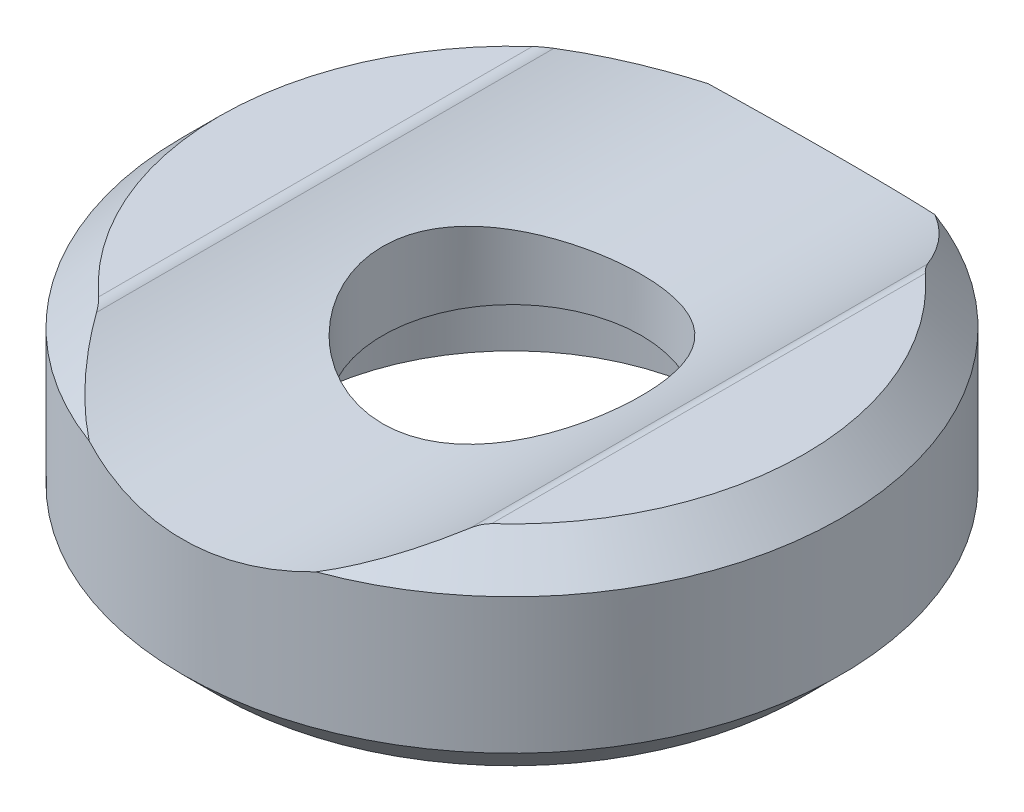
ISO-10303-21;
HEADER;
FILE_DESCRIPTION(('STEP AP214'),'2;1');
FILE_NAME('part.step','',(''),(''),'','','');
FILE_SCHEMA(('AUTOMOTIVE_DESIGN { 1 0 10303 214 1 1 1 1 }'));
ENDSEC;
DATA;
#1=APPLICATION_CONTEXT('core data for automotive mechanical design processes');
#2=APPLICATION_PROTOCOL_DEFINITION('international standard','automotive_design',2000,#1);
#3=PRODUCT_CONTEXT('',#1,'mechanical');
#4=PRODUCT('Part','Part','',(#3));
#5=PRODUCT_RELATED_PRODUCT_CATEGORY('part','',(#4));
#6=PRODUCT_DEFINITION_FORMATION('','',#4);
#7=PRODUCT_DEFINITION_CONTEXT('part definition',#1,'design');
#8=PRODUCT_DEFINITION('design','',#6,#7);
#9=PRODUCT_DEFINITION_SHAPE('','',#8);
#10=(LENGTH_UNIT() NAMED_UNIT(*) SI_UNIT(.MILLI.,.METRE.));
#11=(NAMED_UNIT(*) PLANE_ANGLE_UNIT() SI_UNIT($,.RADIAN.));
#12=(NAMED_UNIT(*) SI_UNIT($,.STERADIAN.) SOLID_ANGLE_UNIT());
#13=UNCERTAINTY_MEASURE_WITH_UNIT(LENGTH_MEASURE(1.E-05),#10,'distance_accuracy_value','');
#14=(GEOMETRIC_REPRESENTATION_CONTEXT(3) GLOBAL_UNCERTAINTY_ASSIGNED_CONTEXT((#13)) GLOBAL_UNIT_ASSIGNED_CONTEXT((#10,
#11,#12)) REPRESENTATION_CONTEXT('',''));
#15=CARTESIAN_POINT('',(0.,0.,0.));
#16=DIRECTION('',(0.,0.,1.));
#17=DIRECTION('',(1.,0.,0.));
#18=AXIS2_PLACEMENT_3D('',#15,#16,#17);
#19=CARTESIAN_POINT('',(0.,0.,0.));
#20=DIRECTION('',(0.,-1.,0.));
#21=DIRECTION('',(0.,0.,-1.));
#22=AXIS2_PLACEMENT_3D('',#19,#20,#21);
#23=CYLINDRICAL_SURFACE('',#22,2.1);
#24=CARTESIAN_POINT('',(-1.4860910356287,2.69361672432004,1.48375652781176));
#25=CARTESIAN_POINT('',(-1.56880387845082,2.7155404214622,1.40091427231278));
#26=CARTESIAN_POINT('',(-1.64455914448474,2.73758521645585,1.3111728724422));
#27=CARTESIAN_POINT('',(-1.78026026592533,2.77951750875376,1.12000215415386));
#28=CARTESIAN_POINT('',(-1.84021054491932,2.79940560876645,1.01857611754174));
#29=CARTESIAN_POINT('',(-1.94267466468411,2.83474834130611,0.806192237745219));
#30=CARTESIAN_POINT('',(-1.98514420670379,2.85019168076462,0.695211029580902));
#31=CARTESIAN_POINT('',(-2.05084769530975,2.87457179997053,0.467015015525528));
#32=CARTESIAN_POINT('',(-2.07408983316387,2.88351135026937,0.349802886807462));
#33=CARTESIAN_POINT('',(-2.09976776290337,2.89341546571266,0.118108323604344));
#34=CARTESIAN_POINT('',(-2.10308730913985,2.89471870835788,0.00373813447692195));
#35=CARTESIAN_POINT('',(-2.09114003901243,2.89008564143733,-0.223867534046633));
#36=CARTESIAN_POINT('',(-2.07587502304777,2.88415003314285,-0.337103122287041));
#37=CARTESIAN_POINT('',(-2.02814783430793,2.86610351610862,-0.555649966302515));
#38=CARTESIAN_POINT('',(-1.99623087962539,2.85418882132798,-0.661097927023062));
#39=CARTESIAN_POINT('',(-1.91662995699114,2.82566831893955,-0.865178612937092));
#40=CARTESIAN_POINT('',(-1.86894242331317,2.80906145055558,-0.963809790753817));
#41=CARTESIAN_POINT('',(-1.75659802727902,2.77207006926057,-1.15644538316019));
#42=CARTESIAN_POINT('',(-1.69125747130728,2.75154620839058,-1.25002387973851));
#43=CARTESIAN_POINT('',(-1.54644899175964,2.70945667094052,-1.42528112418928));
#44=CARTESIAN_POINT('',(-1.46697629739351,2.68789064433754,-1.50695583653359));
#45=CARTESIAN_POINT('',(-1.29121774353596,2.64479444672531,-1.66044059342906));
#46=CARTESIAN_POINT('',(-1.19427113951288,2.62332481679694,-1.73151391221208));
#47=CARTESIAN_POINT('',(-0.989129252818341,2.58401251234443,-1.85634934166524));
#48=CARTESIAN_POINT('',(-0.880935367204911,2.566169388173,-1.91011359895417));
#49=CARTESIAN_POINT('',(-0.65818342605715,2.53639099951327,-1.99771417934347));
#50=CARTESIAN_POINT('',(-0.54376922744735,2.52435815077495,-2.03188161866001));
#51=CARTESIAN_POINT('',(-0.310323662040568,2.50712745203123,-2.08035929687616));
#52=CARTESIAN_POINT('',(-0.191294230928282,2.50192676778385,-2.09467777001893));
#53=CARTESIAN_POINT('',(0.0409855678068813,2.49904531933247,-2.1026367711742));
#54=CARTESIAN_POINT('',(0.154195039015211,2.50096794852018,-2.09736781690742));
#55=CARTESIAN_POINT('',(0.377999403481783,2.51124671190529,-2.06877777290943));
#56=CARTESIAN_POINT('',(0.488594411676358,2.51960256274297,-2.04545747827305));
#57=CARTESIAN_POINT('',(0.702964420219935,2.54175849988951,-1.98197207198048));
#58=CARTESIAN_POINT('',(0.806798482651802,2.55550094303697,-1.94198503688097));
#59=CARTESIAN_POINT('',(1.00637369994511,2.58708195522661,-1.84647198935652));
#60=CARTESIAN_POINT('',(1.10211301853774,2.60492145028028,-1.79094246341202));
#61=CARTESIAN_POINT('',(1.28768413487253,2.64391608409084,-1.66288103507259));
#62=CARTESIAN_POINT('',(1.37702160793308,2.66518821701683,-1.58966860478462));
#63=CARTESIAN_POINT('',(1.54249017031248,2.70821608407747,-1.4296775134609));
#64=CARTESIAN_POINT('',(1.61861661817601,2.72997198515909,-1.34289410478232));
#65=CARTESIAN_POINT('',(1.7586757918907,2.77255507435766,-1.15388749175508));
#66=CARTESIAN_POINT('',(1.82197147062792,2.79330626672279,-1.05117304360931));
#67=CARTESIAN_POINT('',(1.93028609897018,2.83032989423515,-0.835772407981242));
#68=CARTESIAN_POINT('',(1.97531012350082,2.84660357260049,-0.72308899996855));
#69=CARTESIAN_POINT('',(2.04437135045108,2.87212070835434,-0.494356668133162));
#70=CARTESIAN_POINT('',(2.06898959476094,2.88155776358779,-0.378505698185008));
#71=CARTESIAN_POINT('',(2.09838595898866,2.89287153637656,-0.143970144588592));
#72=CARTESIAN_POINT('',(2.10317303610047,2.89475166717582,-0.0252868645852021));
#73=CARTESIAN_POINT('',(2.09302947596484,2.89081878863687,0.203984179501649));
#74=CARTESIAN_POINT('',(2.07925564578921,2.88545707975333,0.314633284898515));
#75=CARTESIAN_POINT('',(2.0345474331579,2.86850105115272,0.531903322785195));
#76=CARTESIAN_POINT('',(2.00361133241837,2.85690610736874,0.638523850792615));
#77=CARTESIAN_POINT('',(1.92538106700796,2.82874468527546,0.845733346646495));
#78=CARTESIAN_POINT('',(1.87797185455,2.81214335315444,0.946273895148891));
#79=CARTESIAN_POINT('',(1.76823487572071,2.77580976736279,1.13823479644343));
#80=CARTESIAN_POINT('',(1.70590248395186,2.75607654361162,1.22965230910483));
#81=CARTESIAN_POINT('',(1.56354398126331,2.71420026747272,1.40677825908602));
#82=CARTESIAN_POINT('',(1.48266050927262,2.69198366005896,1.49178139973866));
#83=CARTESIAN_POINT('',(1.30771206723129,2.64862821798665,1.64729822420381));
#84=CARTESIAN_POINT('',(1.21364442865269,2.62748960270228,1.71780896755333));
#85=CARTESIAN_POINT('',(1.01219419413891,2.58806278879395,1.8438830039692));
#86=CARTESIAN_POINT('',(0.904550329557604,2.56985338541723,1.89905544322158));
#87=CARTESIAN_POINT('',(0.680705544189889,2.53897766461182,1.99028432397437));
#88=CARTESIAN_POINT('',(0.564507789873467,2.52630930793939,2.02634779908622));
#89=CARTESIAN_POINT('',(0.332465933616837,2.50842082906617,2.07675690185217));
#90=CARTESIAN_POINT('',(0.216843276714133,2.5028899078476,2.09201055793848));
#91=CARTESIAN_POINT('',(-0.0154336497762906,2.49885875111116,2.10315739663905));
#92=CARTESIAN_POINT('',(-0.132087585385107,2.50035631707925,2.09905663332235));
#93=CARTESIAN_POINT('',(-0.357950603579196,2.50999810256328,2.07226039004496));
#94=CARTESIAN_POINT('',(-0.467266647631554,2.5178606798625,2.05035267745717));
#95=CARTESIAN_POINT('',(-0.68059181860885,2.53907122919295,1.98974892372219));
#96=CARTESIAN_POINT('',(-0.784599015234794,2.55242118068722,1.95104682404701));
#97=CARTESIAN_POINT('',(-0.996690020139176,2.58515523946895,1.85252806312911));
#98=CARTESIAN_POINT('',(-1.10377973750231,2.60506923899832,1.79074317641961));
#99=CARTESIAN_POINT('',(-1.30515882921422,2.64781592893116,1.6497531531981));
#100=CARTESIAN_POINT('',(-1.39944264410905,2.67064987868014,1.57054048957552));
#101=CARTESIAN_POINT('',(-1.4860910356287,2.69361672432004,1.48375652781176));
#102=B_SPLINE_CURVE_WITH_KNOTS('',3,(#24,#25,#26,#27,#28,#29,#30,#31,#32,#33,#34,#35,#36,#37,
#38,#39,#40,#41,#42,#43,#44,#45,#46,#47,#48,#49,#50,#51,#52,#53,#54,#55,#56,#57,#58,#59,#60,#61,
#62,#63,#64,#65,#66,#67,#68,#69,#70,#71,#72,#73,#74,#75,#76,#77,#78,#79,#80,#81,#82,#83,#84,#85,
#86,#87,#88,#89,#90,#91,#92,#93,#94,#95,#96,#97,#98,#99,#100,#101),.UNSPECIFIED.,.T.,.F.,(4,2,2,
2,2,2,2,2,2,2,2,2,2,2,2,2,2,2,2,2,2,2,2,2,2,2,2,2,2,2,2,2,2,2,2,2,2,2,4),(0.,0.356879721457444,
0.713659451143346,1.07133782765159,1.42886374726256,1.77040538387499,2.11191393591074,
2.44288397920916,2.77392890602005,3.12030756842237,3.46680338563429,3.83137195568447,
4.19589529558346,4.55406284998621,4.91208177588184,5.2504744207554,5.58885216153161,
5.92370358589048,6.25863076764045,6.60941571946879,6.96032366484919,7.3257923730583,
7.69115950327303,8.04572611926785,8.40013256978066,8.73344164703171,9.06678410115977,
9.40250302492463,9.73832613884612,10.0949688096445,10.4516837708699,10.8167942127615,
11.1817701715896,11.5302480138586,11.8786168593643,12.2123623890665,12.546228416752,
12.9199270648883,13.2937874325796),.UNSPECIFIED.);
#103=CARTESIAN_POINT('',(-1.4860910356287,2.69361672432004,1.48375652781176));
#104=VERTEX_POINT('',#103);
#105=EDGE_CURVE('E197',#104,#104,#102,.F.);
#106=ORIENTED_EDGE('',*,*,#105,.T.);
#107=EDGE_LOOP('',(#106));
#108=FACE_BOUND('',#107,.T.);
#109=CARTESIAN_POINT('',(0.,1.64120486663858,0.));
#110=DIRECTION('',(0.,-1.,0.));
#111=DIRECTION('',(0.,0.,-1.));
#112=AXIS2_PLACEMENT_3D('',#109,#110,#111);
#113=CIRCLE('',#112,2.1);
#114=CARTESIAN_POINT('',(0.,1.64120486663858,-2.1));
#115=VERTEX_POINT('',#114);
#116=EDGE_CURVE('E129',#115,#115,#113,.T.);
#117=ORIENTED_EDGE('',*,*,#116,.T.);
#118=EDGE_LOOP('',(#117));
#119=FACE_BOUND('',#118,.T.);
#120=ADVANCED_FACE('F14',(#108,#119),#23,.F.);
#121=CARTESIAN_POINT('',(0.,0.799999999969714,0.));
#122=DIRECTION('',(0.,-1.,0.));
#123=DIRECTION('',(1.,0.,0.));
#124=AXIS2_PLACEMENT_3D('',#121,#122,#123);
#125=CONICAL_SURFACE('',#124,3.49999999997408,1.02974425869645);
#126=ORIENTED_EDGE('',*,*,#116,.F.);
#127=EDGE_LOOP('',(#126));
#128=FACE_BOUND('',#127,.T.);
#129=CARTESIAN_POINT('',(0.,0.8,0.));
#130=DIRECTION('',(0.,-1.,0.));
#131=DIRECTION('',(0.,0.,-1.));
#132=AXIS2_PLACEMENT_3D('',#129,#130,#131);
#133=CIRCLE('',#132,3.5);
#134=CARTESIAN_POINT('',(0.,0.8,-3.5));
#135=VERTEX_POINT('',#134);
#136=EDGE_CURVE('E191',#135,#135,#133,.T.);
#137=ORIENTED_EDGE('',*,*,#136,.T.);
#138=EDGE_LOOP('',(#137));
#139=FACE_BOUND('',#138,.T.);
#140=ADVANCED_FACE('F248',(#128,#139),#125,.F.);
#141=CARTESIAN_POINT('',(0.,0.,0.));
#142=DIRECTION('',(0.,-1.,0.));
#143=DIRECTION('',(0.,0.,-1.));
#144=AXIS2_PLACEMENT_3D('',#141,#142,#143);
#145=CYLINDRICAL_SURFACE('',#144,3.5);
#146=ORIENTED_EDGE('',*,*,#136,.F.);
#147=EDGE_LOOP('',(#146));
#148=FACE_BOUND('',#147,.T.);
#149=CARTESIAN_POINT('',(0.,0.,0.));
#150=DIRECTION('',(0.,-1.,0.));
#151=DIRECTION('',(0.,0.,-1.));
#152=AXIS2_PLACEMENT_3D('',#149,#150,#151);
#153=CIRCLE('',#152,3.5);
#154=CARTESIAN_POINT('',(0.,0.,-3.5));
#155=VERTEX_POINT('',#154);
#156=EDGE_CURVE('E83',#155,#155,#153,.F.);
#157=ORIENTED_EDGE('',*,*,#156,.F.);
#158=EDGE_LOOP('',(#157));
#159=FACE_BOUND('',#158,.T.);
#160=ADVANCED_FACE('F246',(#148,#159),#145,.F.);
#161=CARTESIAN_POINT('',(4.75,3.4,0.));
#162=DIRECTION('',(0.,1.,0.));
#163=DIRECTION('',(0.,0.,1.));
#164=AXIS2_PLACEMENT_3D('',#161,#162,#163);
#165=PLANE('',#164);
#166=CARTESIAN_POINT('',(0.,3.39999999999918,0.));
#167=DIRECTION('',(0.,-1.,0.));
#168=DIRECTION('',(0.,0.,-1.));
#169=AXIS2_PLACEMENT_3D('',#166,#167,#168);
#170=CIRCLE('',#169,4.75000000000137);
#171=CARTESIAN_POINT('',(3.1890437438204,3.39999999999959,-3.52029828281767));
#172=VERTEX_POINT('',#171);
#173=CARTESIAN_POINT('',(3.18904374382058,3.39999999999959,3.5202982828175));
#174=VERTEX_POINT('',#173);
#175=EDGE_CURVE('E160',#172,#174,#170,.T.);
#176=ORIENTED_EDGE('',*,*,#175,.F.);
#177=DIRECTION('',(0.,0.,-1.));
#178=VECTOR('',#177,1.);
#179=CARTESIAN_POINT('',(3.1890437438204,3.4,6.35));
#180=LINE('',#179,#178);
#181=EDGE_CURVE('E78',#174,#172,#180,.T.);
#182=ORIENTED_EDGE('',*,*,#181,.F.);
#183=EDGE_LOOP('',(#176,#182));
#184=FACE_BOUND('',#183,.T.);
#185=ADVANCED_FACE('F140',(#184),#165,.T.);
#186=CARTESIAN_POINT('',(3.1890437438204,3.1,6.35));
#187=DIRECTION('',(0.,0.,-1.));
#188=DIRECTION('',(-1.,0.,0.));
#189=AXIS2_PLACEMENT_3D('',#186,#187,#188);
#190=CYLINDRICAL_SURFACE('',#189,0.300000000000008);
#191=CARTESIAN_POINT('',(3.03220552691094,3.35573770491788,-3.7135805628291));
#192=CARTESIAN_POINT('',(3.04091923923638,3.36107484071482,-3.69957571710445));
#193=CARTESIAN_POINT('',(3.0500043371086,3.36604022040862,-3.68564852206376));
#194=CARTESIAN_POINT('',(3.06898271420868,3.37513163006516,-3.65800132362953));
#195=CARTESIAN_POINT('',(3.07887860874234,3.37925478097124,-3.64428217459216));
#196=CARTESIAN_POINT('',(3.0992822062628,3.38645661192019,-3.61746611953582));
#197=CARTESIAN_POINT('',(3.1097739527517,3.38955432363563,-3.60436227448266));
#198=CARTESIAN_POINT('',(3.13157774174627,3.39465738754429,-3.5786562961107));
#199=CARTESIAN_POINT('',(3.14288843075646,3.39666449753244,-3.56605338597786));
#200=CARTESIAN_POINT('',(3.1601613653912,3.39865800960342,-3.54805497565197));
#201=CARTESIAN_POINT('',(3.16577854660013,3.39915154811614,-3.54238208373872));
#202=CARTESIAN_POINT('',(3.17724223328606,3.39982284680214,-3.53120080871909));
#203=CARTESIAN_POINT('',(3.1830896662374,3.3999991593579,-3.52569329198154));
#204=CARTESIAN_POINT('',(3.18904374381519,3.40000000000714,-3.52029828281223));
#205=B_SPLINE_CURVE_WITH_KNOTS('',3,(#191,#192,#193,#194,#195,#196,#197,#198,#199,#200,#201,
#202,#203,#204),.UNSPECIFIED.,.F.,.F.,(4,2,2,2,2,2,4),(0.,0.0520154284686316,0.1042057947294,
0.155364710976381,0.206440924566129,0.230427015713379,0.254522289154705),.UNSPECIFIED.);
#206=CARTESIAN_POINT('',(3.03220552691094,3.35573770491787,-3.7135805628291));
#207=VERTEX_POINT('',#206);
#208=EDGE_CURVE('E153',#207,#172,#205,.T.);
#209=ORIENTED_EDGE('',*,*,#208,.F.);
#210=DIRECTION('',(0.,0.,-1.));
#211=VECTOR('',#210,1.);
#212=CARTESIAN_POINT('',(3.03220552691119,3.35573770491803,6.35));
#213=LINE('',#212,#211);
#214=CARTESIAN_POINT('',(3.03220552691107,3.35573770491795,3.71358056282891));
#215=VERTEX_POINT('',#214);
#216=EDGE_CURVE('E182',#207,#215,#213,.F.);
#217=ORIENTED_EDGE('',*,*,#216,.T.);
#218=CARTESIAN_POINT('',(3.18904374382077,3.4,3.52029828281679));
#219=CARTESIAN_POINT('',(3.17957230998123,3.39999465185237,3.52888607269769));
#220=CARTESIAN_POINT('',(3.17037189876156,3.3995519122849,3.53774807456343));
#221=CARTESIAN_POINT('',(3.15249357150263,3.39790145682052,3.55589448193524));
#222=CARTESIAN_POINT('',(3.14381493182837,3.3966948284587,3.56517826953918));
#223=CARTESIAN_POINT('',(3.11869143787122,3.39212725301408,3.59329011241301));
#224=CARTESIAN_POINT('',(3.1029386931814,3.38781320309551,3.61258530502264));
#225=CARTESIAN_POINT('',(3.07801784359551,3.37890217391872,3.64546903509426));
#226=CARTESIAN_POINT('',(3.06837865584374,3.37485705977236,3.65886477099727));
#227=CARTESIAN_POINT('',(3.04977146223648,3.36591327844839,3.68600492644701));
#228=CARTESIAN_POINT('',(3.04080934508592,3.36100813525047,3.69975126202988));
#229=CARTESIAN_POINT('',(3.03220552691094,3.35573770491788,3.71358056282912));
#230=B_SPLINE_CURVE_WITH_KNOTS('',3,(#218,#219,#220,#221,#222,#223,#224,#225,#226,#227,#228,
#229),.UNSPECIFIED.,.F.,.F.,(4,2,2,2,2,4),(0.,0.0383164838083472,0.0765785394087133,
0.152204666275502,0.203148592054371,0.254494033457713),.UNSPECIFIED.);
#231=EDGE_CURVE('E145',#174,#215,#230,.T.);
#232=ORIENTED_EDGE('',*,*,#231,.F.);
#233=ORIENTED_EDGE('',*,*,#181,.T.);
#234=EDGE_LOOP('',(#209,#217,#232,#233));
#235=FACE_BOUND('',#234,.T.);
#236=ADVANCED_FACE('F134',(#235),#190,.T.);
#237=CARTESIAN_POINT('',(-3.18904374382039,3.1,6.35));
#238=DIRECTION('',(0.,0.,-1.));
#239=DIRECTION('',(-1.,0.,0.));
#240=AXIS2_PLACEMENT_3D('',#237,#238,#239);
#241=CYLINDRICAL_SURFACE('',#240,0.299999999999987);
#242=CARTESIAN_POINT('',(-3.18904374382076,3.4,3.5202982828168));
#243=CARTESIAN_POINT('',(-3.17957230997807,3.39999465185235,3.5288860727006));
#244=CARTESIAN_POINT('',(-3.17037189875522,3.39955191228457,3.53774807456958));
#245=CARTESIAN_POINT('',(-3.15249357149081,3.39790145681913,3.55589448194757));
#246=CARTESIAN_POINT('',(-3.14381493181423,3.3966948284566,3.56517826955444));
#247=CARTESIAN_POINT('',(-3.11869143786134,3.39212725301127,3.59329011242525));
#248=CARTESIAN_POINT('',(-3.10293869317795,3.38781320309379,3.61258530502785));
#249=CARTESIAN_POINT('',(-3.07801784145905,3.37890217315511,3.64546903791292));
#250=CARTESIAN_POINT('',(-3.06837865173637,3.37485705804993,3.65886477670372));
#251=CARTESIAN_POINT('',(-3.04977145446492,3.36591327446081,3.68600493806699));
#252=CARTESIAN_POINT('',(-3.04080933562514,3.36100812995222,3.69975127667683));
#253=CARTESIAN_POINT('',(-3.0322055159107,3.35573769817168,3.71358058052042));
#254=B_SPLINE_CURVE_WITH_KNOTS('',3,(#242,#243,#244,#245,#246,#247,#248,#249,#250,#251,#252,
#253),.UNSPECIFIED.,.F.,.F.,(4,2,2,2,2,4),(0.,0.0383164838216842,0.0765785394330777,
0.152204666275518,0.203148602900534,0.25449405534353),.UNSPECIFIED.);
#255=CARTESIAN_POINT('',(-3.18904374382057,3.39999999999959,3.52029828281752));
#256=VERTEX_POINT('',#255);
#257=CARTESIAN_POINT('',(-3.03220551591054,3.35573769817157,3.71358058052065));
#258=VERTEX_POINT('',#257);
#259=EDGE_CURVE('E77',#256,#258,#254,.T.);
#260=ORIENTED_EDGE('',*,*,#259,.T.);
#261=DIRECTION('',(0.,0.,-1.));
#262=VECTOR('',#261,1.);
#263=CARTESIAN_POINT('',(-3.0322055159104,3.35573769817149,6.35));
#264=LINE('',#263,#262);
#265=CARTESIAN_POINT('',(-3.03220551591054,3.35573769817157,-3.71358058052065));
#266=VERTEX_POINT('',#265);
#267=EDGE_CURVE('E75',#258,#266,#264,.T.);
#268=ORIENTED_EDGE('',*,*,#267,.T.);
#269=CARTESIAN_POINT('',(-3.03220551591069,3.35573769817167,-3.71358058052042));
#270=CARTESIAN_POINT('',(-3.04091922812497,3.36107483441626,-3.6995757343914));
#271=CARTESIAN_POINT('',(-3.05000432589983,3.36604021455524,-3.68564853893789));
#272=CARTESIAN_POINT('',(-3.06898270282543,3.37513162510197,-3.6580013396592));
#273=CARTESIAN_POINT('',(-3.07887859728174,3.37925477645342,-3.64428219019));
#274=CARTESIAN_POINT('',(-3.09928219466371,3.38645660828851,-3.61746613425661));
#275=CARTESIAN_POINT('',(-3.10977394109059,3.38955432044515,-3.6043622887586));
#276=CARTESIAN_POINT('',(-3.13157772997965,3.39465738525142,-3.57865630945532));
#277=CARTESIAN_POINT('',(-3.14288841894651,3.39666449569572,-3.56605339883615));
#278=CARTESIAN_POINT('',(-3.16016135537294,3.39865800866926,-3.5480549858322));
#279=CARTESIAN_POINT('',(-3.16577853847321,3.3991515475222,-3.54238209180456));
#280=CARTESIAN_POINT('',(-3.17724222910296,3.39982284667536,-3.53120081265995));
#281=CARTESIAN_POINT('',(-3.18308966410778,3.39999915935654,-3.52569329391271));
#282=CARTESIAN_POINT('',(-3.18904374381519,3.40000000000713,-3.52029828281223));
#283=B_SPLINE_CURVE_WITH_KNOTS('',3,(#269,#270,#271,#272,#273,#274,#275,#276,#277,#278,#279,
#280,#281,#282),.UNSPECIFIED.,.F.,.F.,(4,2,2,2,2,2,4),(0.,0.0520154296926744,0.104205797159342,
0.155364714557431,0.206440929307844,0.230427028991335,0.254522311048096),.UNSPECIFIED.);
#284=CARTESIAN_POINT('',(-3.18904374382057,3.39999999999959,-3.52029828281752));
#285=VERTEX_POINT('',#284);
#286=EDGE_CURVE('E67',#266,#285,#283,.T.);
#287=ORIENTED_EDGE('',*,*,#286,.T.);
#288=DIRECTION('',(0.,0.,1.));
#289=VECTOR('',#288,1.);
#290=CARTESIAN_POINT('',(-3.18904374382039,3.4,0.));
#291=LINE('',#290,#289);
#292=EDGE_CURVE('E73',#256,#285,#291,.F.);
#293=ORIENTED_EDGE('',*,*,#292,.F.);
#294=EDGE_LOOP('',(#260,#268,#287,#293));
#295=FACE_BOUND('',#294,.T.);
#296=ADVANCED_FACE('F72',(#295),#241,.T.);
#297=CARTESIAN_POINT('',(4.75,3.4,0.));
#298=DIRECTION('',(0.,1.,0.));
#299=DIRECTION('',(0.,0.,1.));
#300=AXIS2_PLACEMENT_3D('',#297,#298,#299);
#301=PLANE('',#300);
#302=ORIENTED_EDGE('',*,*,#292,.T.);
#303=CARTESIAN_POINT('',(0.,3.39999999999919,0.));
#304=DIRECTION('',(0.,-1.,0.));
#305=DIRECTION('',(0.,0.,-1.));
#306=AXIS2_PLACEMENT_3D('',#303,#304,#305);
#307=CIRCLE('',#306,4.75000000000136);
#308=EDGE_CURVE('E82',#256,#285,#307,.T.);
#309=ORIENTED_EDGE('',*,*,#308,.F.);
#310=EDGE_LOOP('',(#302,#309));
#311=FACE_BOUND('',#310,.T.);
#312=ADVANCED_FACE('F81',(#311),#301,.T.);
#313=CARTESIAN_POINT('',(3.5,0.,0.));
#314=DIRECTION('',(0.,-1.,0.));
#315=DIRECTION('',(0.,0.,-1.));
#316=AXIS2_PLACEMENT_3D('',#313,#314,#315);
#317=PLANE('',#316);
#318=ORIENTED_EDGE('',*,*,#156,.T.);
#319=EDGE_LOOP('',(#318));
#320=FACE_BOUND('',#319,.T.);
#321=CARTESIAN_POINT('',(0.,0.,0.));
#322=DIRECTION('',(0.,1.,0.));
#323=DIRECTION('',(0.,0.,1.));
#324=AXIS2_PLACEMENT_3D('',#321,#322,#323);
#325=CIRCLE('',#324,4.75000000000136);
#326=CARTESIAN_POINT('',(0.,0.,4.75000000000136));
#327=VERTEX_POINT('',#326);
#328=EDGE_CURVE('E86',#327,#327,#325,.T.);
#329=ORIENTED_EDGE('',*,*,#328,.F.);
#330=EDGE_LOOP('',(#329));
#331=FACE_BOUND('',#330,.T.);
#332=ADVANCED_FACE('F164',(#320,#331),#317,.T.);
#333=CARTESIAN_POINT('',(0.,2.79999999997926,0.));
#334=DIRECTION('',(0.,-1.,0.));
#335=DIRECTION('',(0.,0.,-1.));
#336=AXIS2_PLACEMENT_3D('',#333,#334,#335);
#337=CONICAL_SURFACE('',#336,5.35000000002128,0.785398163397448);
#338=ORIENTED_EDGE('',*,*,#231,.T.);
#339=CARTESIAN_POINT('',(3.03220552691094,3.35573770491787,3.7135805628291));
#340=CARTESIAN_POINT('',(2.95373914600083,3.30764336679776,3.83969593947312));
#341=CARTESIAN_POINT('',(2.87031289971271,3.25902339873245,3.96264552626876));
#342=CARTESIAN_POINT('',(2.69373311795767,3.16249972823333,4.1998110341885));
#343=CARTESIAN_POINT('',(2.60066920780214,3.11459345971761,4.31409285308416));
#344=CARTESIAN_POINT('',(2.40368575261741,3.02039667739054,4.53372365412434));
#345=CARTESIAN_POINT('',(2.29976702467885,2.97410604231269,4.63907330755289));
#346=CARTESIAN_POINT('',(2.07968558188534,2.88436731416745,4.83963302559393));
#347=CARTESIAN_POINT('',(1.9634246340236,2.84094730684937,4.93474738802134));
#348=CARTESIAN_POINT('',(1.84119526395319,2.80000000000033,5.02319619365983));
#349=B_SPLINE_CURVE_WITH_KNOTS('',3,(#339,#340,#341,#342,#343,#344,#345,#346,#347,#348),
.UNSPECIFIED.,.F.,.F.,(4,2,2,2,4),(0.,0.468402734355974,0.932785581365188,1.39713349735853,
1.86550237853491),.UNSPECIFIED.);
#350=CARTESIAN_POINT('',(1.84119526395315,2.80000000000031,5.02319619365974));
#351=VERTEX_POINT('',#350);
#352=EDGE_CURVE('E177',#215,#351,#349,.T.);
#353=ORIENTED_EDGE('',*,*,#352,.T.);
#354=CARTESIAN_POINT('',(0.,2.80000000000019,0.));
#355=DIRECTION('',(0.,-1.,0.));
#356=DIRECTION('',(0.,0.,-1.));
#357=AXIS2_PLACEMENT_3D('',#354,#355,#356);
#358=CIRCLE('',#357,5.35);
#359=CARTESIAN_POINT('',(1.84119526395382,2.80000000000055,-5.02319619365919));
#360=VERTEX_POINT('',#359);
#361=EDGE_CURVE('E195',#360,#351,#358,.T.);
#362=ORIENTED_EDGE('',*,*,#361,.F.);
#363=CARTESIAN_POINT('',(1.84119526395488,2.8000000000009,-5.02319619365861));
#364=CARTESIAN_POINT('',(1.946242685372,2.83518227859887,-4.94720104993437));
#365=CARTESIAN_POINT('',(2.04690015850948,2.87220892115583,-4.86624249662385));
#366=CARTESIAN_POINT('',(2.23956598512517,2.94882044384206,-4.69592428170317));
#367=CARTESIAN_POINT('',(2.33158503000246,2.98840205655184,-4.60657528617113));
#368=CARTESIAN_POINT('',(2.50622847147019,3.068564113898,-4.42200739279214));
#369=CARTESIAN_POINT('',(2.58895912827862,3.10912497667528,-4.32687953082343));
#370=CARTESIAN_POINT('',(2.74673075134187,3.19085494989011,-4.13070966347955));
#371=CARTESIAN_POINT('',(2.82177237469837,3.23202400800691,-4.02966816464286));
#372=CARTESIAN_POINT('',(2.91710023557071,3.28688813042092,-3.89126957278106));
#373=CARTESIAN_POINT('',(2.94066331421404,3.30067757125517,-3.85616726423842));
#374=CARTESIAN_POINT('',(2.98702192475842,3.32823684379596,-3.78532762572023));
#375=CARTESIAN_POINT('',(3.00981562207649,3.34200656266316,-3.74958905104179));
#376=CARTESIAN_POINT('',(3.032205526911,3.35573770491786,-3.71358056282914));
#377=B_SPLINE_CURVE_WITH_KNOTS('',3,(#363,#364,#365,#366,#367,#368,#369,#370,#371,#372,#373,
#374,#375,#376),.UNSPECIFIED.,.F.,.F.,(4,2,2,2,2,2,4),(0.,0.402649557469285,0.80479401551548,
1.20172890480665,1.59862984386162,1.73203114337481,1.86573081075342),.UNSPECIFIED.);
#378=EDGE_CURVE('E170',#360,#207,#377,.T.);
#379=ORIENTED_EDGE('',*,*,#378,.T.);
#380=ORIENTED_EDGE('',*,*,#208,.T.);
#381=ORIENTED_EDGE('',*,*,#175,.T.);
#382=EDGE_LOOP('',(#338,#353,#362,#379,#380,#381));
#383=FACE_BOUND('',#382,.T.);
#384=ADVANCED_FACE('F161',(#383),#337,.T.);
#385=CARTESIAN_POINT('',(0.,8.3,6.35));
#386=DIRECTION('',(0.,0.,-1.));
#387=DIRECTION('',(-1.,0.,0.));
#388=AXIS2_PLACEMENT_3D('',#385,#386,#387);
#389=CYLINDRICAL_SURFACE('',#388,5.8);
#390=ORIENTED_EDGE('',*,*,#105,.F.);
#391=EDGE_LOOP('',(#390));
#392=FACE_BOUND('',#391,.T.);
#393=CARTESIAN_POINT('',(-1.84119526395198,2.79999999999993,-5.02319619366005));
#394=CARTESIAN_POINT('',(-1.73808655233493,2.76546798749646,-5.06100395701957));
#395=CARTESIAN_POINT('',(-1.63300722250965,2.73353080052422,-5.09590380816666));
#396=CARTESIAN_POINT('',(-1.41939518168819,2.6752744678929,-5.15947719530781));
#397=CARTESIAN_POINT('',(-1.31086046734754,2.64895865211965,-5.18814704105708));
#398=CARTESIAN_POINT('',(-1.09112006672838,2.60245158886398,-5.23876475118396));
#399=CARTESIAN_POINT('',(-0.979918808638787,2.5822508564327,-5.26072302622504));
#400=CARTESIAN_POINT('',(-0.755409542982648,2.54828378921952,-5.29762132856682));
#401=CARTESIAN_POINT('',(-0.642102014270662,2.53451601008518,-5.3125629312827));
#402=CARTESIAN_POINT('',(-0.413658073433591,2.51362825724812,-5.33522420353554));
#403=CARTESIAN_POINT('',(-0.298515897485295,2.50653708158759,-5.34291258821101));
#404=CARTESIAN_POINT('',(-0.0677584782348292,2.49924698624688,-5.35081655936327));
#405=CARTESIAN_POINT('',(0.0478567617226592,2.49904801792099,-5.35103219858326));
#406=CARTESIAN_POINT('',(0.278634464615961,2.50554756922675,-5.34398549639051));
#407=CARTESIAN_POINT('',(0.393797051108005,2.5122440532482,-5.33672536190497));
#408=CARTESIAN_POINT('',(0.622780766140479,2.53238621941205,-5.31487402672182));
#409=CARTESIAN_POINT('',(0.736602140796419,2.54583064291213,-5.30028419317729));
#410=CARTESIAN_POINT('',(1.02119085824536,2.58797239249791,-5.25451041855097));
#411=CARTESIAN_POINT('',(1.19061726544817,2.62096935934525,-5.21863871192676));
#412=CARTESIAN_POINT('',(1.43909202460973,2.68072025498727,-5.15353056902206));
#413=CARTESIAN_POINT('',(1.52096673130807,2.7023444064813,-5.12994666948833));
#414=CARTESIAN_POINT('',(1.68266044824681,2.74880933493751,-5.07920475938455));
#415=CARTESIAN_POINT('',(1.7624797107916,2.77364971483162,-5.0520471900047));
#416=CARTESIAN_POINT('',(1.8411952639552,2.80000000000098,-5.02319619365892));
#417=B_SPLINE_CURVE_WITH_KNOTS('',3,(#393,#394,#395,#396,#397,#398,#399,#400,#401,#402,#403,
#404,#405,#406,#407,#408,#409,#410,#411,#412,#413,#414,#415,#416),.UNSPECIFIED.,.F.,.F.,(4,2,2,
2,2,2,2,2,2,2,2,4),(0.,0.345334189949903,0.690872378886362,1.03587183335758,1.38079378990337,
1.7271967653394,2.07359729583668,2.41989559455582,2.76612932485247,3.29338881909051,
3.55697807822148,3.82053482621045),.UNSPECIFIED.);
#418=CARTESIAN_POINT('',(-1.84119526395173,2.79999999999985,-5.02319619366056));
#419=VERTEX_POINT('',#418);
#420=EDGE_CURVE('E89',#419,#360,#417,.T.);
#421=ORIENTED_EDGE('',*,*,#420,.F.);
#422=CARTESIAN_POINT('',(-3.03220551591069,3.35573769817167,-3.71358058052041));
#423=CARTESIAN_POINT('',(-2.95373913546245,3.3076433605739,-3.83969595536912));
#424=CARTESIAN_POINT('',(-2.87031288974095,3.25902339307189,-3.96264554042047));
#425=CARTESIAN_POINT('',(-2.6937331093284,3.16249972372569,-4.19981104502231));
#426=CARTESIAN_POINT('',(-2.60066919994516,3.11459345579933,-4.31409286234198));
#427=CARTESIAN_POINT('',(-2.40368574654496,3.0203966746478,-4.53372366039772));
#428=CARTESIAN_POINT('',(-2.29976701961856,2.97410604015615,-4.63907331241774));
#429=CARTESIAN_POINT('',(-2.07968557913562,2.88436731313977,-4.83963302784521));
#430=CARTESIAN_POINT('',(-1.96342463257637,2.84094730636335,-4.93474738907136));
#431=CARTESIAN_POINT('',(-1.84119526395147,2.79999999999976,-5.02319619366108));
#432=B_SPLINE_CURVE_WITH_KNOTS('',3,(#422,#423,#424,#425,#426,#427,#428,#429,#430,#431),
.UNSPECIFIED.,.F.,.F.,(4,2,2,2,4),(0.,0.468402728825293,0.932785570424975,1.39713348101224,
1.86550235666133),.UNSPECIFIED.);
#433=EDGE_CURVE('E91',#266,#419,#432,.T.);
#434=ORIENTED_EDGE('',*,*,#433,.F.);
#435=ORIENTED_EDGE('',*,*,#267,.F.);
#436=CARTESIAN_POINT('',(-1.84119526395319,2.80000000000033,5.02319619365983));
#437=CARTESIAN_POINT('',(-1.94624268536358,2.83518227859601,4.94720104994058));
#438=CARTESIAN_POINT('',(-2.04690015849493,2.87220892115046,4.8662424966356));
#439=CARTESIAN_POINT('',(-2.23956598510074,2.94882044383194,4.69592428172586));
#440=CARTESIAN_POINT('',(-2.33158502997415,2.98840205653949,4.60657528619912));
#441=CARTESIAN_POINT('',(-2.50622847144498,3.0685641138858,4.42200739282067));
#442=CARTESIAN_POINT('',(-2.58895912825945,3.10912497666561,4.3268795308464));
#443=CARTESIAN_POINT('',(-2.74673075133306,3.1908549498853,4.13070966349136));
#444=CARTESIAN_POINT('',(-2.82177237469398,3.23202400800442,4.02966816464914));
#445=CARTESIAN_POINT('',(-2.9171002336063,3.28688812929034,3.89126957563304));
#446=CARTESIAN_POINT('',(-2.94066331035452,3.30067756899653,3.856167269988));
#447=CARTESIAN_POINT('',(-2.98702191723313,3.32823683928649,3.78532763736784));
#448=CARTESIAN_POINT('',(-3.009815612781,3.34200655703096,3.74958906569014));
#449=CARTESIAN_POINT('',(-3.03220551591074,3.35573769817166,3.71358058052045));
#450=B_SPLINE_CURVE_WITH_KNOTS('',3,(#436,#437,#438,#439,#440,#441,#442,#443,#444,#445,#446,
#447,#448,#449),.UNSPECIFIED.,.F.,.F.,(4,2,2,2,2,2,4),(0.,0.402649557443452,0.804794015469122,
1.20172890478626,1.59862984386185,1.73203113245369,1.86573078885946),.UNSPECIFIED.);
#451=CARTESIAN_POINT('',(-1.84119526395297,2.80000000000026,5.0231961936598));
#452=VERTEX_POINT('',#451);
#453=EDGE_CURVE('E33',#452,#258,#450,.T.);
#454=ORIENTED_EDGE('',*,*,#453,.F.);
#455=CARTESIAN_POINT('',(1.84119526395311,2.8000000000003,5.02319619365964));
#456=CARTESIAN_POINT('',(1.73808655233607,2.76546798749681,5.06100395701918));
#457=CARTESIAN_POINT('',(1.63300722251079,2.73353080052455,5.09590380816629));
#458=CARTESIAN_POINT('',(1.41939518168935,2.67527446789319,5.15947719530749));
#459=CARTESIAN_POINT('',(1.3108604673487,2.64895865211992,5.18814704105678));
#460=CARTESIAN_POINT('',(1.09112006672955,2.6024515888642,5.23876475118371));
#461=CARTESIAN_POINT('',(0.979918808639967,2.5822508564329,5.26072302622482));
#462=CARTESIAN_POINT('',(0.755409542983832,2.54828378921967,5.29762132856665));
#463=CARTESIAN_POINT('',(0.642102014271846,2.53451601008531,5.31256293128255));
#464=CARTESIAN_POINT('',(0.413658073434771,2.5136282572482,5.33522420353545));
#465=CARTESIAN_POINT('',(0.298515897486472,2.50653708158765,5.34291258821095));
#466=CARTESIAN_POINT('',(0.0677584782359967,2.49924698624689,5.35081655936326));
#467=CARTESIAN_POINT('',(-0.0478567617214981,2.49904801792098,5.35103219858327));
#468=CARTESIAN_POINT('',(-0.278634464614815,2.50554756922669,5.34398549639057));
#469=CARTESIAN_POINT('',(-0.393797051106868,2.51224405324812,5.33672536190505));
#470=CARTESIAN_POINT('',(-0.622780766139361,2.53238621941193,5.31487402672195));
#471=CARTESIAN_POINT('',(-0.736602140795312,2.54583064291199,5.30028419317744));
#472=CARTESIAN_POINT('',(-1.02119085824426,2.58797239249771,5.25451041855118));
#473=CARTESIAN_POINT('',(-1.19061726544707,2.62096935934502,5.21863871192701));
#474=CARTESIAN_POINT('',(-1.43909202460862,2.68072025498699,5.15353056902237));
#475=CARTESIAN_POINT('',(-1.52096673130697,2.702344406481,5.12994666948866));
#476=CARTESIAN_POINT('',(-1.68266044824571,2.74880933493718,5.07920475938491));
#477=CARTESIAN_POINT('',(-1.7624797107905,2.77364971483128,5.05204719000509));
#478=CARTESIAN_POINT('',(-1.84119526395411,2.80000000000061,5.02319619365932));
#479=B_SPLINE_CURVE_WITH_KNOTS('',3,(#455,#456,#457,#458,#459,#460,#461,#462,#463,#464,#465,
#466,#467,#468,#469,#470,#471,#472,#473,#474,#475,#476,#477,#478),.UNSPECIFIED.,.F.,.F.,(4,2,2,
2,2,2,2,2,2,2,2,4),(0.,0.345334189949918,0.690872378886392,1.03587183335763,1.38079378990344,
1.72719676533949,2.07359729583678,2.41989559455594,2.76612932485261,3.2933888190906,
3.55697807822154,3.82053482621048),.UNSPECIFIED.);
#480=EDGE_CURVE('E199',#351,#452,#479,.T.);
#481=ORIENTED_EDGE('',*,*,#480,.F.);
#482=ORIENTED_EDGE('',*,*,#352,.F.);
#483=ORIENTED_EDGE('',*,*,#216,.F.);
#484=ORIENTED_EDGE('',*,*,#378,.F.);
#485=EDGE_LOOP('',(#421,#434,#435,#454,#481,#482,#483,#484));
#486=FACE_BOUND('',#485,.T.);
#487=ADVANCED_FACE('F107',(#392,#486),#389,.F.);
#488=CARTESIAN_POINT('',(0.,2.79999999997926,0.));
#489=DIRECTION('',(0.,-1.,0.));
#490=DIRECTION('',(0.,0.,-1.));
#491=AXIS2_PLACEMENT_3D('',#488,#489,#490);
#492=CONICAL_SURFACE('',#491,5.35000000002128,0.785398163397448);
#493=ORIENTED_EDGE('',*,*,#259,.F.);
#494=ORIENTED_EDGE('',*,*,#308,.T.);
#495=ORIENTED_EDGE('',*,*,#286,.F.);
#496=ORIENTED_EDGE('',*,*,#433,.T.);
#497=CARTESIAN_POINT('',(0.,2.80000000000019,0.));
#498=DIRECTION('',(0.,-1.,0.));
#499=DIRECTION('',(0.,0.,-1.));
#500=AXIS2_PLACEMENT_3D('',#497,#498,#499);
#501=CIRCLE('',#500,5.35);
#502=EDGE_CURVE('E24',#452,#419,#501,.T.);
#503=ORIENTED_EDGE('',*,*,#502,.F.);
#504=ORIENTED_EDGE('',*,*,#453,.T.);
#505=EDGE_LOOP('',(#493,#494,#495,#496,#503,#504));
#506=FACE_BOUND('',#505,.T.);
#507=ADVANCED_FACE('F85',(#506),#492,.T.);
#508=CARTESIAN_POINT('',(0.,0.600000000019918,0.));
#509=DIRECTION('',(0.,1.,0.));
#510=DIRECTION('',(0.,0.,1.));
#511=AXIS2_PLACEMENT_3D('',#508,#509,#510);
#512=CONICAL_SURFACE('',#511,5.35000000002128,0.785398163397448);
#513=ORIENTED_EDGE('',*,*,#328,.T.);
#514=EDGE_LOOP('',(#513));
#515=FACE_BOUND('',#514,.T.);
#516=CARTESIAN_POINT('',(0.,0.6,0.));
#517=DIRECTION('',(0.,-1.,0.));
#518=DIRECTION('',(0.,0.,-1.));
#519=AXIS2_PLACEMENT_3D('',#516,#517,#518);
#520=CIRCLE('',#519,5.35);
#521=CARTESIAN_POINT('',(0.,0.6,-5.35));
#522=VERTEX_POINT('',#521);
#523=EDGE_CURVE('E9',#522,#522,#520,.F.);
#524=ORIENTED_EDGE('',*,*,#523,.F.);
#525=EDGE_LOOP('',(#524));
#526=FACE_BOUND('',#525,.T.);
#527=ADVANCED_FACE('F113',(#515,#526),#512,.T.);
#528=CARTESIAN_POINT('',(0.,0.,0.));
#529=DIRECTION('',(0.,-1.,0.));
#530=DIRECTION('',(0.,0.,-1.));
#531=AXIS2_PLACEMENT_3D('',#528,#529,#530);
#532=CYLINDRICAL_SURFACE('',#531,5.35);
#533=ORIENTED_EDGE('',*,*,#523,.T.);
#534=EDGE_LOOP('',(#533));
#535=FACE_BOUND('',#534,.T.);
#536=ORIENTED_EDGE('',*,*,#480,.T.);
#537=ORIENTED_EDGE('',*,*,#502,.T.);
#538=ORIENTED_EDGE('',*,*,#420,.T.);
#539=ORIENTED_EDGE('',*,*,#361,.T.);
#540=EDGE_LOOP('',(#536,#537,#538,#539));
#541=FACE_BOUND('',#540,.T.);
#542=ADVANCED_FACE('F203',(#535,#541),#532,.T.);
#543=CLOSED_SHELL('',(#120,#140,#160,#185,#236,#296,#312,#332,#384,#487,#507,#527,#542));
#544=MANIFOLD_SOLID_BREP('B1',#543);
#545=ADVANCED_BREP_SHAPE_REPRESENTATION('',(#18,#544),#14);
#546=SHAPE_DEFINITION_REPRESENTATION(#9,#545);
ENDSEC;
END-ISO-10303-21;
